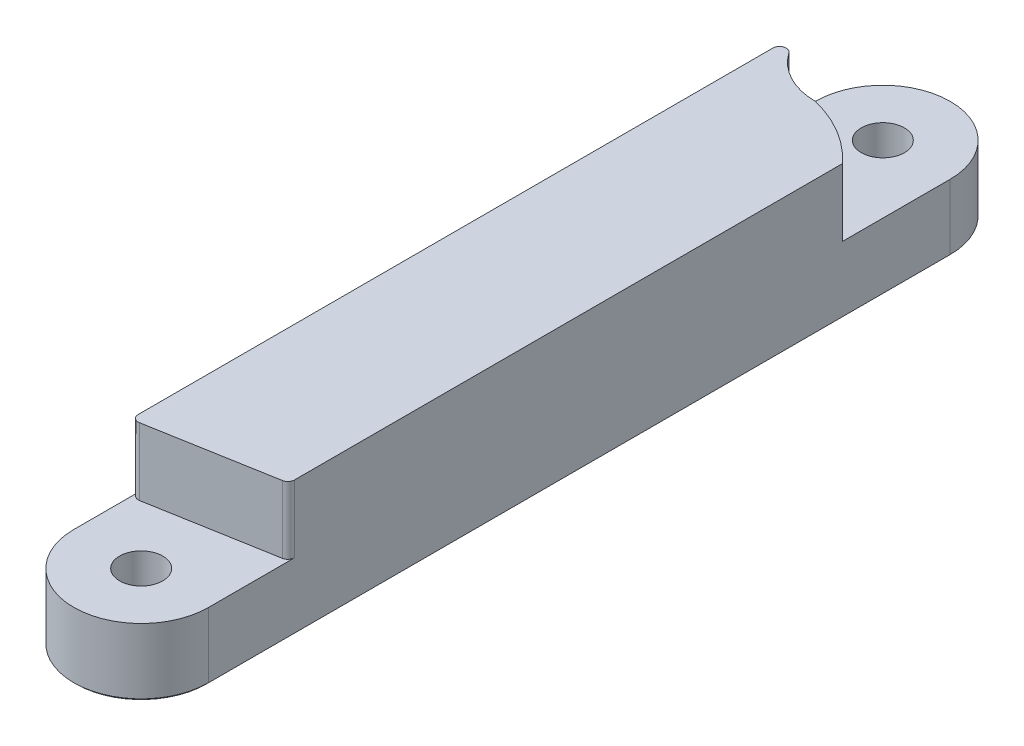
ISO-10303-21;
HEADER;
FILE_DESCRIPTION(('STEP AP214'),'2;1');
FILE_NAME('part.step','',(''),(''),'','','');
FILE_SCHEMA(('AUTOMOTIVE_DESIGN { 1 0 10303 214 1 1 1 1 }'));
ENDSEC;
DATA;
#1=APPLICATION_CONTEXT('core data for automotive mechanical design processes');
#2=APPLICATION_PROTOCOL_DEFINITION('international standard','automotive_design',2000,#1);
#3=PRODUCT_CONTEXT('',#1,'mechanical');
#4=PRODUCT('Part','Part','',(#3));
#5=PRODUCT_RELATED_PRODUCT_CATEGORY('part','',(#4));
#6=PRODUCT_DEFINITION_FORMATION('','',#4);
#7=PRODUCT_DEFINITION_CONTEXT('part definition',#1,'design');
#8=PRODUCT_DEFINITION('design','',#6,#7);
#9=PRODUCT_DEFINITION_SHAPE('','',#8);
#10=(LENGTH_UNIT() NAMED_UNIT(*) SI_UNIT(.MILLI.,.METRE.));
#11=(NAMED_UNIT(*) PLANE_ANGLE_UNIT() SI_UNIT($,.RADIAN.));
#12=(NAMED_UNIT(*) SI_UNIT($,.STERADIAN.) SOLID_ANGLE_UNIT());
#13=UNCERTAINTY_MEASURE_WITH_UNIT(LENGTH_MEASURE(1.E-05),#10,'distance_accuracy_value','');
#14=(GEOMETRIC_REPRESENTATION_CONTEXT(3) GLOBAL_UNCERTAINTY_ASSIGNED_CONTEXT((#13)) GLOBAL_UNIT_ASSIGNED_CONTEXT((#10,
#11,#12)) REPRESENTATION_CONTEXT('',''));
#15=CARTESIAN_POINT('',(0.,0.,0.));
#16=DIRECTION('',(0.,0.,1.));
#17=DIRECTION('',(1.,0.,0.));
#18=AXIS2_PLACEMENT_3D('',#15,#16,#17);
#19=CARTESIAN_POINT('',(-5.,10.,0.));
#20=DIRECTION('',(-1.,0.,0.));
#21=DIRECTION('',(0.,0.,1.));
#22=AXIS2_PLACEMENT_3D('',#19,#20,#21);
#23=PLANE('',#22);
#24=DIRECTION('',(0.,0.,-1.));
#25=VECTOR('',#24,1.);
#26=CARTESIAN_POINT('',(-5.,10.,0.));
#27=LINE('',#26,#25);
#28=CARTESIAN_POINT('',(-5.,10.,-4.79137495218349));
#29=VERTEX_POINT('',#28);
#30=CARTESIAN_POINT('',(-5.,10.,-51.8377223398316));
#31=VERTEX_POINT('',#30);
#32=EDGE_CURVE('E276',#29,#31,#27,.T.);
#33=ORIENTED_EDGE('',*,*,#32,.T.);
#34=DIRECTION('',(0.,1.,0.));
#35=VECTOR('',#34,1.);
#36=CARTESIAN_POINT('',(-5.,5.,-51.8377223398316));
#37=LINE('',#36,#35);
#38=CARTESIAN_POINT('',(-5.,5.,-51.8377223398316));
#39=VERTEX_POINT('',#38);
#40=EDGE_CURVE('E267',#31,#39,#37,.F.);
#41=ORIENTED_EDGE('',*,*,#40,.T.);
#42=DIRECTION('',(0.,0.,-1.));
#43=VECTOR('',#42,1.);
#44=CARTESIAN_POINT('',(-5.,5.,0.));
#45=LINE('',#44,#43);
#46=CARTESIAN_POINT('',(-5.,5.,-55.));
#47=VERTEX_POINT('',#46);
#48=EDGE_CURVE('E249',#39,#47,#45,.T.);
#49=ORIENTED_EDGE('',*,*,#48,.T.);
#50=DIRECTION('',(0.,-1.,0.));
#51=VECTOR('',#50,1.);
#52=CARTESIAN_POINT('',(-5.,5.,-55.));
#53=LINE('',#52,#51);
#54=CARTESIAN_POINT('',(-5.,0.16,-55.));
#55=VERTEX_POINT('',#54);
#56=EDGE_CURVE('E290',#47,#55,#53,.T.);
#57=ORIENTED_EDGE('',*,*,#56,.T.);
#58=DIRECTION('',(0.,0.,1.));
#59=VECTOR('',#58,1.);
#60=CARTESIAN_POINT('',(-5.,0.16,0.));
#61=LINE('',#60,#59);
#62=CARTESIAN_POINT('',(-5.,0.16,0.));
#63=VERTEX_POINT('',#62);
#64=EDGE_CURVE('E246',#55,#63,#61,.T.);
#65=ORIENTED_EDGE('',*,*,#64,.T.);
#66=DIRECTION('',(0.,-1.,0.));
#67=VECTOR('',#66,1.);
#68=CARTESIAN_POINT('',(-5.,5.,0.));
#69=LINE('',#68,#67);
#70=CARTESIAN_POINT('',(-5.,5.,0.));
#71=VERTEX_POINT('',#70);
#72=EDGE_CURVE('E283',#71,#63,#69,.T.);
#73=ORIENTED_EDGE('',*,*,#72,.F.);
#74=DIRECTION('',(0.,0.,-1.));
#75=VECTOR('',#74,1.);
#76=CARTESIAN_POINT('',(-5.,5.,0.));
#77=LINE('',#76,#75);
#78=CARTESIAN_POINT('',(-5.,5.,-4.79137495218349));
#79=VERTEX_POINT('',#78);
#80=EDGE_CURVE('E342',#71,#79,#77,.T.);
#81=ORIENTED_EDGE('',*,*,#80,.T.);
#82=DIRECTION('',(0.,-1.,0.));
#83=VECTOR('',#82,1.);
#84=CARTESIAN_POINT('',(-5.,10.,-4.79137495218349));
#85=LINE('',#84,#83);
#86=EDGE_CURVE('E197',#79,#29,#85,.F.);
#87=ORIENTED_EDGE('',*,*,#86,.T.);
#88=EDGE_LOOP('',(#33,#41,#49,#57,#65,#73,#81,#87));
#89=FACE_BOUND('',#88,.T.);
#90=ADVANCED_FACE('F47',(#89),#23,.T.);
#91=CARTESIAN_POINT('',(-0.868240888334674,10.,-4.92403876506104));
#92=DIRECTION('',(0.173648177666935,0.,0.984807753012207));
#93=DIRECTION('',(0.984807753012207,0.,-0.173648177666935));
#94=AXIS2_PLACEMENT_3D('',#91,#92,#93);
#95=PLANE('',#94);
#96=DIRECTION('',(-0.984807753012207,0.,0.173648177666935));
#97=VECTOR('',#96,1.);
#98=CARTESIAN_POINT('',(-0.868240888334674,5.,-4.92403876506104));
#99=LINE('',#98,#97);
#100=CARTESIAN_POINT('',(4.58682408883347,5.,-5.88591390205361));
#101=VERTEX_POINT('',#100);
#102=CARTESIAN_POINT('',(-4.41317591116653,5.,-4.29897107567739));
#103=VERTEX_POINT('',#102);
#104=EDGE_CURVE('E322',#101,#103,#99,.T.);
#105=ORIENTED_EDGE('',*,*,#104,.F.);
#106=DIRECTION('',(0.,-1.,0.));
#107=VECTOR('',#106,1.);
#108=CARTESIAN_POINT('',(4.58682408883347,10.,-5.88591390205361));
#109=LINE('',#108,#107);
#110=CARTESIAN_POINT('',(4.58682408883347,10.,-5.88591390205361));
#111=VERTEX_POINT('',#110);
#112=EDGE_CURVE('E189',#101,#111,#109,.F.);
#113=ORIENTED_EDGE('',*,*,#112,.T.);
#114=DIRECTION('',(-0.984807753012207,0.,0.173648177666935));
#115=VECTOR('',#114,1.);
#116=CARTESIAN_POINT('',(-0.868240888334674,10.,-4.92403876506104));
#117=LINE('',#116,#115);
#118=CARTESIAN_POINT('',(-4.41317591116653,10.,-4.29897107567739));
#119=VERTEX_POINT('',#118);
#120=EDGE_CURVE('E162',#111,#119,#117,.T.);
#121=ORIENTED_EDGE('',*,*,#120,.T.);
#122=DIRECTION('',(0.,-1.,0.));
#123=VECTOR('',#122,1.);
#124=CARTESIAN_POINT('',(-4.41317591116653,10.,-4.29897107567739));
#125=LINE('',#124,#123);
#126=EDGE_CURVE('E182',#119,#103,#125,.T.);
#127=ORIENTED_EDGE('',*,*,#126,.T.);
#128=EDGE_LOOP('',(#105,#113,#121,#127));
#129=FACE_BOUND('',#128,.T.);
#130=ADVANCED_FACE('F335',(#129),#95,.T.);
#131=CARTESIAN_POINT('',(5.,10.,0.));
#132=DIRECTION('',(-1.,0.,0.));
#133=DIRECTION('',(0.,0.,1.));
#134=AXIS2_PLACEMENT_3D('',#131,#132,#133);
#135=PLANE('',#134);
#136=DIRECTION('',(0.,-1.,0.));
#137=VECTOR('',#136,1.);
#138=CARTESIAN_POINT('',(5.,5.,0.));
#139=LINE('',#138,#137);
#140=CARTESIAN_POINT('',(5.,5.,0.));
#141=VERTEX_POINT('',#140);
#142=CARTESIAN_POINT('',(5.,0.16,0.));
#143=VERTEX_POINT('',#142);
#144=EDGE_CURVE('E317',#141,#143,#139,.T.);
#145=ORIENTED_EDGE('',*,*,#144,.T.);
#146=DIRECTION('',(0.,0.,-1.));
#147=VECTOR('',#146,1.);
#148=CARTESIAN_POINT('',(5.,0.16,0.));
#149=LINE('',#148,#147);
#150=CARTESIAN_POINT('',(5.,0.16,-55.));
#151=VERTEX_POINT('',#150);
#152=EDGE_CURVE('E240',#143,#151,#149,.T.);
#153=ORIENTED_EDGE('',*,*,#152,.T.);
#154=DIRECTION('',(0.,-1.,0.));
#155=VECTOR('',#154,1.);
#156=CARTESIAN_POINT('',(5.,5.,-55.));
#157=LINE('',#156,#155);
#158=CARTESIAN_POINT('',(5.,5.,-55.));
#159=VERTEX_POINT('',#158);
#160=EDGE_CURVE('E296',#159,#151,#157,.T.);
#161=ORIENTED_EDGE('',*,*,#160,.F.);
#162=DIRECTION('',(0.,0.,-1.));
#163=VECTOR('',#162,1.);
#164=CARTESIAN_POINT('',(5.,5.,0.));
#165=LINE('',#164,#163);
#166=CARTESIAN_POINT('',(5.,5.,-47.));
#167=VERTEX_POINT('',#166);
#168=EDGE_CURVE('E177',#167,#159,#165,.T.);
#169=ORIENTED_EDGE('',*,*,#168,.F.);
#170=DIRECTION('',(0.,-1.,0.));
#171=VECTOR('',#170,1.);
#172=CARTESIAN_POINT('',(5.,10.,-47.));
#173=LINE('',#172,#171);
#174=CARTESIAN_POINT('',(5.,10.,-47.));
#175=VERTEX_POINT('',#174);
#176=EDGE_CURVE('E161',#175,#167,#173,.T.);
#177=ORIENTED_EDGE('',*,*,#176,.F.);
#178=DIRECTION('',(0.,0.,-1.));
#179=VECTOR('',#178,1.);
#180=CARTESIAN_POINT('',(5.,10.,0.));
#181=LINE('',#180,#179);
#182=CARTESIAN_POINT('',(5.,10.,-6.37831777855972));
#183=VERTEX_POINT('',#182);
#184=EDGE_CURVE('E148',#183,#175,#181,.T.);
#185=ORIENTED_EDGE('',*,*,#184,.F.);
#186=DIRECTION('',(0.,-1.,0.));
#187=VECTOR('',#186,1.);
#188=CARTESIAN_POINT('',(5.,5.,-6.37831777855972));
#189=LINE('',#188,#187);
#190=CARTESIAN_POINT('',(5.,5.,-6.37831777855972));
#191=VERTEX_POINT('',#190);
#192=EDGE_CURVE('E179',#183,#191,#189,.T.);
#193=ORIENTED_EDGE('',*,*,#192,.T.);
#194=DIRECTION('',(0.,0.,-1.));
#195=VECTOR('',#194,1.);
#196=CARTESIAN_POINT('',(5.,5.,0.));
#197=LINE('',#196,#195);
#198=EDGE_CURVE('E319',#141,#191,#197,.T.);
#199=ORIENTED_EDGE('',*,*,#198,.F.);
#200=EDGE_LOOP('',(#145,#153,#161,#169,#177,#185,#193,#199));
#201=FACE_BOUND('',#200,.T.);
#202=ADVANCED_FACE('F174',(#201),#135,.F.);
#203=CARTESIAN_POINT('',(0.,10.,0.));
#204=DIRECTION('',(0.,1.,0.));
#205=DIRECTION('',(0.,0.,1.));
#206=AXIS2_PLACEMENT_3D('',#203,#204,#205);
#207=PLANE('',#206);
#208=CARTESIAN_POINT('',(0.,10.,-55.));
#209=DIRECTION('',(0.,-1.,0.));
#210=DIRECTION('',(0.,0.,1.));
#211=AXIS2_PLACEMENT_3D('',#208,#209,#210);
#212=CIRCLE('',#211,5.00000000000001);
#213=CARTESIAN_POINT('',(0.,10.,-50.));
#214=VERTEX_POINT('',#213);
#215=CARTESIAN_POINT('',(-4.09090909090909,10.,-52.1252021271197));
#216=VERTEX_POINT('',#215);
#217=EDGE_CURVE('E170',#214,#216,#212,.T.);
#218=ORIENTED_EDGE('',*,*,#217,.T.);
#219=CARTESIAN_POINT('',(-4.5,10.,-51.8377223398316));
#220=DIRECTION('',(0.,1.,0.));
#221=DIRECTION('',(0.,0.,1.));
#222=AXIS2_PLACEMENT_3D('',#219,#220,#221);
#223=CIRCLE('',#222,0.5);
#224=EDGE_CURVE('E56',#216,#31,#223,.T.);
#225=ORIENTED_EDGE('',*,*,#224,.T.);
#226=ORIENTED_EDGE('',*,*,#32,.F.);
#227=CARTESIAN_POINT('',(-4.5,10.,-4.79137495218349));
#228=DIRECTION('',(0.,1.,0.));
#229=DIRECTION('',(0.,0.,1.));
#230=AXIS2_PLACEMENT_3D('',#227,#228,#229);
#231=CIRCLE('',#230,0.5);
#232=EDGE_CURVE('E192',#29,#119,#231,.T.);
#233=ORIENTED_EDGE('',*,*,#232,.T.);
#234=ORIENTED_EDGE('',*,*,#120,.F.);
#235=CARTESIAN_POINT('',(4.5,10.,-6.37831777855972));
#236=DIRECTION('',(0.,1.,0.));
#237=DIRECTION('',(0.,0.,1.));
#238=AXIS2_PLACEMENT_3D('',#235,#236,#237);
#239=CIRCLE('',#238,0.5);
#240=EDGE_CURVE('E155',#111,#183,#239,.T.);
#241=ORIENTED_EDGE('',*,*,#240,.T.);
#242=ORIENTED_EDGE('',*,*,#184,.T.);
#243=CARTESIAN_POINT('',(-2.42144168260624,10.,-40.2975971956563));
#244=DIRECTION('',(0.,1.,0.));
#245=DIRECTION('',(0.,0.,-1.));
#246=AXIS2_PLACEMENT_3D('',#243,#244,#245);
#247=CIRCLE('',#246,10.);
#248=EDGE_CURVE('E151',#175,#214,#247,.T.);
#249=ORIENTED_EDGE('',*,*,#248,.T.);
#250=EDGE_LOOP('',(#218,#225,#226,#233,#234,#241,#242,#249));
#251=FACE_BOUND('',#250,.T.);
#252=ADVANCED_FACE('F150',(#251),#207,.T.);
#253=CARTESIAN_POINT('',(0.,0.,0.));
#254=DIRECTION('',(0.,1.,0.));
#255=DIRECTION('',(0.,0.,1.));
#256=AXIS2_PLACEMENT_3D('',#253,#254,#255);
#257=PLANE('',#256);
#258=CARTESIAN_POINT('',(0.,0.,-55.));
#259=DIRECTION('',(0.,1.,0.));
#260=DIRECTION('',(0.,0.,1.));
#261=AXIS2_PLACEMENT_3D('',#258,#259,#260);
#262=CIRCLE('',#261,1.76);
#263=CARTESIAN_POINT('',(0.,0.,-53.24));
#264=VERTEX_POINT('',#263);
#265=EDGE_CURVE('E224',#264,#264,#262,.T.);
#266=ORIENTED_EDGE('',*,*,#265,.T.);
#267=EDGE_LOOP('',(#266));
#268=FACE_BOUND('',#267,.T.);
#269=CARTESIAN_POINT('',(0.,0.,0.));
#270=DIRECTION('',(0.,1.,0.));
#271=DIRECTION('',(0.,0.,1.));
#272=AXIS2_PLACEMENT_3D('',#269,#270,#271);
#273=CIRCLE('',#272,1.76);
#274=CARTESIAN_POINT('',(0.,0.,1.76));
#275=VERTEX_POINT('',#274);
#276=EDGE_CURVE('E220',#275,#275,#273,.T.);
#277=ORIENTED_EDGE('',*,*,#276,.T.);
#278=EDGE_LOOP('',(#277));
#279=FACE_BOUND('',#278,.T.);
#280=DIRECTION('',(0.,0.,1.));
#281=VECTOR('',#280,1.);
#282=CARTESIAN_POINT('',(4.84,0.,0.));
#283=LINE('',#282,#281);
#284=CARTESIAN_POINT('',(4.84,0.,-55.));
#285=VERTEX_POINT('',#284);
#286=CARTESIAN_POINT('',(4.84,0.,0.));
#287=VERTEX_POINT('',#286);
#288=EDGE_CURVE('E213',#285,#287,#283,.T.);
#289=ORIENTED_EDGE('',*,*,#288,.T.);
#290=CARTESIAN_POINT('',(0.,0.,0.));
#291=DIRECTION('',(0.,1.,0.));
#292=DIRECTION('',(0.,0.,1.));
#293=AXIS2_PLACEMENT_3D('',#290,#291,#292);
#294=CIRCLE('',#293,4.84);
#295=CARTESIAN_POINT('',(-4.84,0.,0.));
#296=VERTEX_POINT('',#295);
#297=EDGE_CURVE('E216',#287,#296,#294,.F.);
#298=ORIENTED_EDGE('',*,*,#297,.T.);
#299=DIRECTION('',(0.,0.,-1.));
#300=VECTOR('',#299,1.);
#301=CARTESIAN_POINT('',(-4.84,0.,-55.));
#302=LINE('',#301,#300);
#303=CARTESIAN_POINT('',(-4.84,0.,-55.));
#304=VERTEX_POINT('',#303);
#305=EDGE_CURVE('E207',#296,#304,#302,.T.);
#306=ORIENTED_EDGE('',*,*,#305,.T.);
#307=CARTESIAN_POINT('',(0.,0.,-55.));
#308=DIRECTION('',(0.,1.,0.));
#309=DIRECTION('',(0.,0.,1.));
#310=AXIS2_PLACEMENT_3D('',#307,#308,#309);
#311=CIRCLE('',#310,4.84);
#312=EDGE_CURVE('E210',#304,#285,#311,.F.);
#313=ORIENTED_EDGE('',*,*,#312,.T.);
#314=EDGE_LOOP('',(#289,#298,#306,#313));
#315=FACE_BOUND('',#314,.T.);
#316=ADVANCED_FACE('F365',(#268,#279,#315),#257,.F.);
#317=CARTESIAN_POINT('',(0.,5.,0.));
#318=DIRECTION('',(0.,-1.,0.));
#319=DIRECTION('',(0.,0.,-1.));
#320=AXIS2_PLACEMENT_3D('',#317,#318,#319);
#321=CYLINDRICAL_SURFACE('',#320,5.);
#322=ORIENTED_EDGE('',*,*,#72,.T.);
#323=CARTESIAN_POINT('',(0.,0.16,0.));
#324=DIRECTION('',(0.,1.,0.));
#325=DIRECTION('',(0.,0.,1.));
#326=AXIS2_PLACEMENT_3D('',#323,#324,#325);
#327=CIRCLE('',#326,5.);
#328=EDGE_CURVE('E236',#63,#143,#327,.T.);
#329=ORIENTED_EDGE('',*,*,#328,.T.);
#330=ORIENTED_EDGE('',*,*,#144,.F.);
#331=CARTESIAN_POINT('',(0.,5.,0.));
#332=DIRECTION('',(0.,1.,0.));
#333=DIRECTION('',(0.,0.,1.));
#334=AXIS2_PLACEMENT_3D('',#331,#332,#333);
#335=CIRCLE('',#334,5.);
#336=EDGE_CURVE('E418',#71,#141,#335,.T.);
#337=ORIENTED_EDGE('',*,*,#336,.F.);
#338=EDGE_LOOP('',(#322,#329,#330,#337));
#339=FACE_BOUND('',#338,.T.);
#340=ADVANCED_FACE('F315',(#339),#321,.T.);
#341=CARTESIAN_POINT('',(0.,5.,0.));
#342=DIRECTION('',(0.,-1.,0.));
#343=DIRECTION('',(0.,0.,-1.));
#344=AXIS2_PLACEMENT_3D('',#341,#342,#343);
#345=CYLINDRICAL_SURFACE('',#344,1.6);
#346=CARTESIAN_POINT('',(0.,0.160000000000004,0.));
#347=DIRECTION('',(0.,1.,0.));
#348=DIRECTION('',(0.,0.,1.));
#349=AXIS2_PLACEMENT_3D('',#346,#347,#348);
#350=CIRCLE('',#349,1.6);
#351=CARTESIAN_POINT('',(0.,0.160000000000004,1.6));
#352=VERTEX_POINT('',#351);
#353=EDGE_CURVE('E232',#352,#352,#350,.F.);
#354=ORIENTED_EDGE('',*,*,#353,.T.);
#355=EDGE_LOOP('',(#354));
#356=FACE_BOUND('',#355,.T.);
#357=CARTESIAN_POINT('',(0.,5.,0.));
#358=DIRECTION('',(0.,1.,0.));
#359=DIRECTION('',(0.,0.,1.));
#360=AXIS2_PLACEMENT_3D('',#357,#358,#359);
#361=CIRCLE('',#360,1.6);
#362=CARTESIAN_POINT('',(0.,5.,1.6));
#363=VERTEX_POINT('',#362);
#364=EDGE_CURVE('E412',#363,#363,#361,.T.);
#365=ORIENTED_EDGE('',*,*,#364,.T.);
#366=EDGE_LOOP('',(#365));
#367=FACE_BOUND('',#366,.T.);
#368=ADVANCED_FACE('F371',(#356,#367),#345,.F.);
#369=CARTESIAN_POINT('',(0.,5.,0.));
#370=DIRECTION('',(0.,1.,0.));
#371=DIRECTION('',(0.,0.,1.));
#372=AXIS2_PLACEMENT_3D('',#369,#370,#371);
#373=PLANE('',#372);
#374=ORIENTED_EDGE('',*,*,#364,.F.);
#375=EDGE_LOOP('',(#374));
#376=FACE_BOUND('',#375,.T.);
#377=ORIENTED_EDGE('',*,*,#80,.F.);
#378=ORIENTED_EDGE('',*,*,#336,.T.);
#379=ORIENTED_EDGE('',*,*,#198,.T.);
#380=CARTESIAN_POINT('',(4.5,5.,-6.37831777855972));
#381=DIRECTION('',(0.,1.,0.));
#382=DIRECTION('',(0.,0.,1.));
#383=AXIS2_PLACEMENT_3D('',#380,#381,#382);
#384=CIRCLE('',#383,0.5);
#385=EDGE_CURVE('E200',#191,#101,#384,.F.);
#386=ORIENTED_EDGE('',*,*,#385,.T.);
#387=ORIENTED_EDGE('',*,*,#104,.T.);
#388=CARTESIAN_POINT('',(-4.5,5.,-4.79137495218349));
#389=DIRECTION('',(0.,1.,0.));
#390=DIRECTION('',(0.,0.,1.));
#391=AXIS2_PLACEMENT_3D('',#388,#389,#390);
#392=CIRCLE('',#391,0.5);
#393=EDGE_CURVE('E203',#103,#79,#392,.F.);
#394=ORIENTED_EDGE('',*,*,#393,.T.);
#395=EDGE_LOOP('',(#377,#378,#379,#386,#387,#394));
#396=FACE_BOUND('',#395,.T.);
#397=ADVANCED_FACE('F341',(#376,#396),#373,.T.);
#398=CARTESIAN_POINT('',(0.,5.,-55.));
#399=DIRECTION('',(0.,-1.,0.));
#400=DIRECTION('',(0.,0.,-1.));
#401=AXIS2_PLACEMENT_3D('',#398,#399,#400);
#402=CYLINDRICAL_SURFACE('',#401,5.);
#403=ORIENTED_EDGE('',*,*,#160,.T.);
#404=CARTESIAN_POINT('',(0.,0.16,-55.));
#405=DIRECTION('',(0.,1.,0.));
#406=DIRECTION('',(0.,0.,1.));
#407=AXIS2_PLACEMENT_3D('',#404,#405,#406);
#408=CIRCLE('',#407,5.);
#409=EDGE_CURVE('E243',#151,#55,#408,.T.);
#410=ORIENTED_EDGE('',*,*,#409,.T.);
#411=ORIENTED_EDGE('',*,*,#56,.F.);
#412=CARTESIAN_POINT('',(0.,5.,-55.));
#413=DIRECTION('',(0.,1.,0.));
#414=DIRECTION('',(0.,0.,1.));
#415=AXIS2_PLACEMENT_3D('',#412,#413,#414);
#416=CIRCLE('',#415,5.);
#417=EDGE_CURVE('E287',#159,#47,#416,.T.);
#418=ORIENTED_EDGE('',*,*,#417,.F.);
#419=EDGE_LOOP('',(#403,#410,#411,#418));
#420=FACE_BOUND('',#419,.T.);
#421=ADVANCED_FACE('F379',(#420),#402,.T.);
#422=CARTESIAN_POINT('',(0.,5.,-55.));
#423=DIRECTION('',(0.,-1.,0.));
#424=DIRECTION('',(0.,0.,-1.));
#425=AXIS2_PLACEMENT_3D('',#422,#423,#424);
#426=CYLINDRICAL_SURFACE('',#425,1.6);
#427=CARTESIAN_POINT('',(0.,0.16000000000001,-55.));
#428=DIRECTION('',(0.,1.,0.));
#429=DIRECTION('',(0.,0.,1.));
#430=AXIS2_PLACEMENT_3D('',#427,#428,#429);
#431=CIRCLE('',#430,1.6);
#432=CARTESIAN_POINT('',(0.,0.16000000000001,-53.4));
#433=VERTEX_POINT('',#432);
#434=EDGE_CURVE('E228',#433,#433,#431,.F.);
#435=ORIENTED_EDGE('',*,*,#434,.T.);
#436=EDGE_LOOP('',(#435));
#437=FACE_BOUND('',#436,.T.);
#438=CARTESIAN_POINT('',(0.,5.,-55.));
#439=DIRECTION('',(0.,1.,0.));
#440=DIRECTION('',(0.,0.,1.));
#441=AXIS2_PLACEMENT_3D('',#438,#439,#440);
#442=CIRCLE('',#441,1.6);
#443=CARTESIAN_POINT('',(0.,5.,-53.4));
#444=VERTEX_POINT('',#443);
#445=EDGE_CURVE('E402',#444,#444,#442,.T.);
#446=ORIENTED_EDGE('',*,*,#445,.T.);
#447=EDGE_LOOP('',(#446));
#448=FACE_BOUND('',#447,.T.);
#449=ADVANCED_FACE('F381',(#437,#448),#426,.F.);
#450=CARTESIAN_POINT('',(0.,5.,0.));
#451=DIRECTION('',(0.,1.,0.));
#452=DIRECTION('',(0.,0.,1.));
#453=AXIS2_PLACEMENT_3D('',#450,#451,#452);
#454=PLANE('',#453);
#455=ORIENTED_EDGE('',*,*,#445,.F.);
#456=EDGE_LOOP('',(#455));
#457=FACE_BOUND('',#456,.T.);
#458=ORIENTED_EDGE('',*,*,#417,.T.);
#459=ORIENTED_EDGE('',*,*,#48,.F.);
#460=CARTESIAN_POINT('',(-4.5,5.,-51.8377223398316));
#461=DIRECTION('',(0.,1.,0.));
#462=DIRECTION('',(0.,0.,1.));
#463=AXIS2_PLACEMENT_3D('',#460,#461,#462);
#464=CIRCLE('',#463,0.5);
#465=CARTESIAN_POINT('',(-4.09090909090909,5.,-52.1252021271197));
#466=VERTEX_POINT('',#465);
#467=EDGE_CURVE('E11',#39,#466,#464,.F.);
#468=ORIENTED_EDGE('',*,*,#467,.T.);
#469=CARTESIAN_POINT('',(0.,5.,-55.));
#470=DIRECTION('',(0.,-1.,0.));
#471=DIRECTION('',(0.,0.,1.));
#472=AXIS2_PLACEMENT_3D('',#469,#470,#471);
#473=CIRCLE('',#472,5.00000000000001);
#474=CARTESIAN_POINT('',(0.,5.,-50.));
#475=VERTEX_POINT('',#474);
#476=EDGE_CURVE('E264',#475,#466,#473,.T.);
#477=ORIENTED_EDGE('',*,*,#476,.F.);
#478=CARTESIAN_POINT('',(-2.42144168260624,5.,-40.2975971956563));
#479=DIRECTION('',(0.,1.,0.));
#480=DIRECTION('',(0.,0.,-1.));
#481=AXIS2_PLACEMENT_3D('',#478,#479,#480);
#482=CIRCLE('',#481,10.);
#483=EDGE_CURVE('E394',#167,#475,#482,.T.);
#484=ORIENTED_EDGE('',*,*,#483,.F.);
#485=ORIENTED_EDGE('',*,*,#168,.T.);
#486=EDGE_LOOP('',(#458,#459,#468,#477,#484,#485));
#487=FACE_BOUND('',#486,.T.);
#488=ADVANCED_FACE('F286',(#457,#487),#454,.T.);
#489=CARTESIAN_POINT('',(0.,10.,-55.));
#490=DIRECTION('',(0.,-1.,0.));
#491=DIRECTION('',(0.,0.,-1.));
#492=AXIS2_PLACEMENT_3D('',#489,#490,#491);
#493=CYLINDRICAL_SURFACE('',#492,5.00000000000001);
#494=ORIENTED_EDGE('',*,*,#476,.T.);
#495=DIRECTION('',(0.,-1.,0.));
#496=VECTOR('',#495,1.);
#497=CARTESIAN_POINT('',(-4.09090909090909,10.,-52.1252021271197));
#498=LINE('',#497,#496);
#499=EDGE_CURVE('E63',#466,#216,#498,.F.);
#500=ORIENTED_EDGE('',*,*,#499,.T.);
#501=ORIENTED_EDGE('',*,*,#217,.F.);
#502=DIRECTION('',(0.,-1.,0.));
#503=VECTOR('',#502,1.);
#504=CARTESIAN_POINT('',(0.,10.,-50.));
#505=LINE('',#504,#503);
#506=EDGE_CURVE('E168',#214,#475,#505,.T.);
#507=ORIENTED_EDGE('',*,*,#506,.T.);
#508=EDGE_LOOP('',(#494,#500,#501,#507));
#509=FACE_BOUND('',#508,.T.);
#510=ADVANCED_FACE('F354',(#509),#493,.F.);
#511=CARTESIAN_POINT('',(-2.42144168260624,10.,-40.2975971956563));
#512=DIRECTION('',(0.,-1.,0.));
#513=DIRECTION('',(0.,0.,-1.));
#514=AXIS2_PLACEMENT_3D('',#511,#512,#513);
#515=CYLINDRICAL_SURFACE('',#514,10.);
#516=ORIENTED_EDGE('',*,*,#483,.T.);
#517=ORIENTED_EDGE('',*,*,#506,.F.);
#518=ORIENTED_EDGE('',*,*,#248,.F.);
#519=ORIENTED_EDGE('',*,*,#176,.T.);
#520=EDGE_LOOP('',(#516,#517,#518,#519));
#521=FACE_BOUND('',#520,.T.);
#522=ADVANCED_FACE('F165',(#521),#515,.T.);
#523=CARTESIAN_POINT('',(4.5,10.,-6.37831777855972));
#524=DIRECTION('',(0.,1.,0.));
#525=DIRECTION('',(0.,0.,1.));
#526=AXIS2_PLACEMENT_3D('',#523,#524,#525);
#527=CYLINDRICAL_SURFACE('',#526,0.5);
#528=ORIENTED_EDGE('',*,*,#240,.F.);
#529=ORIENTED_EDGE('',*,*,#112,.F.);
#530=ORIENTED_EDGE('',*,*,#385,.F.);
#531=ORIENTED_EDGE('',*,*,#192,.F.);
#532=EDGE_LOOP('',(#528,#529,#530,#531));
#533=FACE_BOUND('',#532,.T.);
#534=ADVANCED_FACE('F345',(#533),#527,.T.);
#535=CARTESIAN_POINT('',(-4.5,10.,-4.79137495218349));
#536=DIRECTION('',(0.,-1.,0.));
#537=DIRECTION('',(0.,0.,-1.));
#538=AXIS2_PLACEMENT_3D('',#535,#536,#537);
#539=CYLINDRICAL_SURFACE('',#538,0.5);
#540=ORIENTED_EDGE('',*,*,#232,.F.);
#541=ORIENTED_EDGE('',*,*,#86,.F.);
#542=ORIENTED_EDGE('',*,*,#393,.F.);
#543=ORIENTED_EDGE('',*,*,#126,.F.);
#544=EDGE_LOOP('',(#540,#541,#542,#543));
#545=FACE_BOUND('',#544,.T.);
#546=ADVANCED_FACE('F338',(#545),#539,.T.);
#547=CARTESIAN_POINT('',(0.,0.,-55.));
#548=DIRECTION('',(0.,-1.,0.));
#549=DIRECTION('',(0.,0.,-1.));
#550=AXIS2_PLACEMENT_3D('',#547,#548,#549);
#551=CONICAL_SURFACE('',#550,1.76,0.78539816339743);
#552=ORIENTED_EDGE('',*,*,#434,.F.);
#553=EDGE_LOOP('',(#552));
#554=FACE_BOUND('',#553,.T.);
#555=ORIENTED_EDGE('',*,*,#265,.F.);
#556=EDGE_LOOP('',(#555));
#557=FACE_BOUND('',#556,.T.);
#558=ADVANCED_FACE('F352',(#554,#557),#551,.F.);
#559=CARTESIAN_POINT('',(0.,0.,0.));
#560=DIRECTION('',(0.,-1.,0.));
#561=DIRECTION('',(0.,0.,-1.));
#562=AXIS2_PLACEMENT_3D('',#559,#560,#561);
#563=CONICAL_SURFACE('',#562,1.76,0.78539816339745);
#564=ORIENTED_EDGE('',*,*,#353,.F.);
#565=EDGE_LOOP('',(#564));
#566=FACE_BOUND('',#565,.T.);
#567=ORIENTED_EDGE('',*,*,#276,.F.);
#568=EDGE_LOOP('',(#567));
#569=FACE_BOUND('',#568,.T.);
#570=ADVANCED_FACE('F514',(#566,#569),#563,.F.);
#571=CARTESIAN_POINT('',(0.,0.16,-55.));
#572=DIRECTION('',(0.,1.,0.));
#573=DIRECTION('',(0.,0.,1.));
#574=AXIS2_PLACEMENT_3D('',#571,#572,#573);
#575=CONICAL_SURFACE('',#574,5.,0.785398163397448);
#576=DIRECTION('',(0.707106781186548,0.707106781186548,0.));
#577=VECTOR('',#576,1.);
#578=CARTESIAN_POINT('',(4.84,0.,-55.));
#579=LINE('',#578,#577);
#580=EDGE_CURVE('E256',#285,#151,#579,.T.);
#581=ORIENTED_EDGE('',*,*,#580,.F.);
#582=ORIENTED_EDGE('',*,*,#312,.F.);
#583=DIRECTION('',(0.707106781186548,-0.707106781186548,0.));
#584=VECTOR('',#583,1.);
#585=CARTESIAN_POINT('',(-5.,0.16,-55.));
#586=LINE('',#585,#584);
#587=EDGE_CURVE('E260',#55,#304,#586,.T.);
#588=ORIENTED_EDGE('',*,*,#587,.F.);
#589=ORIENTED_EDGE('',*,*,#409,.F.);
#590=EDGE_LOOP('',(#581,#582,#588,#589));
#591=FACE_BOUND('',#590,.T.);
#592=ADVANCED_FACE('F302',(#591),#575,.T.);
#593=CARTESIAN_POINT('',(-4.84,0.,0.));
#594=DIRECTION('',(-0.707106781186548,-0.707106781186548,0.));
#595=DIRECTION('',(0.,0.,1.));
#596=AXIS2_PLACEMENT_3D('',#593,#594,#595);
#597=PLANE('',#596);
#598=ORIENTED_EDGE('',*,*,#587,.T.);
#599=ORIENTED_EDGE('',*,*,#305,.F.);
#600=DIRECTION('',(0.707106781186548,-0.707106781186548,0.));
#601=VECTOR('',#600,1.);
#602=CARTESIAN_POINT('',(-5.,0.16,0.));
#603=LINE('',#602,#601);
#604=EDGE_CURVE('E253',#63,#296,#603,.T.);
#605=ORIENTED_EDGE('',*,*,#604,.F.);
#606=ORIENTED_EDGE('',*,*,#64,.F.);
#607=EDGE_LOOP('',(#598,#599,#605,#606));
#608=FACE_BOUND('',#607,.T.);
#609=ADVANCED_FACE('F306',(#608),#597,.T.);
#610=CARTESIAN_POINT('',(5.,0.16,0.));
#611=DIRECTION('',(-0.707106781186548,0.707106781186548,0.));
#612=DIRECTION('',(0.,0.,-1.));
#613=AXIS2_PLACEMENT_3D('',#610,#611,#612);
#614=PLANE('',#613);
#615=ORIENTED_EDGE('',*,*,#580,.T.);
#616=ORIENTED_EDGE('',*,*,#152,.F.);
#617=DIRECTION('',(0.707106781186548,0.707106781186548,0.));
#618=VECTOR('',#617,1.);
#619=CARTESIAN_POINT('',(4.84,0.,0.));
#620=LINE('',#619,#618);
#621=EDGE_CURVE('E250',#287,#143,#620,.T.);
#622=ORIENTED_EDGE('',*,*,#621,.F.);
#623=ORIENTED_EDGE('',*,*,#288,.F.);
#624=EDGE_LOOP('',(#615,#616,#622,#623));
#625=FACE_BOUND('',#624,.T.);
#626=ADVANCED_FACE('F543',(#625),#614,.F.);
#627=CARTESIAN_POINT('',(0.,0.16,0.));
#628=DIRECTION('',(0.,1.,0.));
#629=DIRECTION('',(0.,0.,1.));
#630=AXIS2_PLACEMENT_3D('',#627,#628,#629);
#631=CONICAL_SURFACE('',#630,5.,0.785398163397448);
#632=ORIENTED_EDGE('',*,*,#604,.T.);
#633=ORIENTED_EDGE('',*,*,#297,.F.);
#634=ORIENTED_EDGE('',*,*,#621,.T.);
#635=ORIENTED_EDGE('',*,*,#328,.F.);
#636=EDGE_LOOP('',(#632,#633,#634,#635));
#637=FACE_BOUND('',#636,.T.);
#638=ADVANCED_FACE('F310',(#637),#631,.T.);
#639=CARTESIAN_POINT('',(-4.5,10.,-51.8377223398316));
#640=DIRECTION('',(0.,-1.,0.));
#641=DIRECTION('',(0.,0.,-1.));
#642=AXIS2_PLACEMENT_3D('',#639,#640,#641);
#643=CYLINDRICAL_SURFACE('',#642,0.5);
#644=ORIENTED_EDGE('',*,*,#224,.F.);
#645=ORIENTED_EDGE('',*,*,#499,.F.);
#646=ORIENTED_EDGE('',*,*,#467,.F.);
#647=ORIENTED_EDGE('',*,*,#40,.F.);
#648=EDGE_LOOP('',(#644,#645,#646,#647));
#649=FACE_BOUND('',#648,.T.);
#650=ADVANCED_FACE('F49',(#649),#643,.T.);
#651=CLOSED_SHELL('',(#90,#130,#202,#252,#316,#340,#368,#397,#421,#449,#488,#510,#522,#534,#546,
#558,#570,#592,#609,#626,#638,#650));
#652=MANIFOLD_SOLID_BREP('B2',#651);
#653=ADVANCED_BREP_SHAPE_REPRESENTATION('',(#18,#652),#14);
#654=SHAPE_DEFINITION_REPRESENTATION(#9,#653);
ENDSEC;
END-ISO-10303-21;
